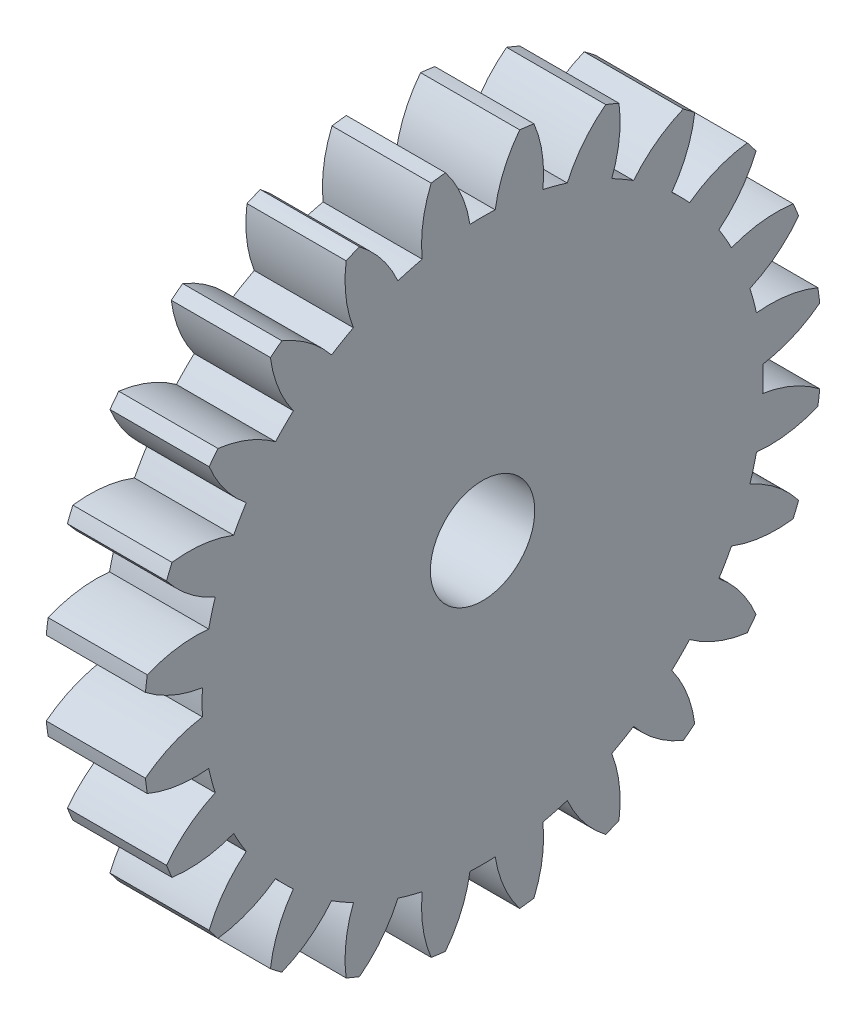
from build123d import *

# Parameters (mm, degrees)
BASPROSKE_W     = 1.9
BASPROSKE_H     = 6.5
TOOTHCUT_DEPTH  = 10.386692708
TEETHCUTS_COUNT = 24
BORSKE_R        = 1
BORE_DEPTH      = 50.0000508


with BuildPart() as part:
    # BasProSke → Base-Revolve (revolve)
    with BuildSketch(Plane(origin=(0, 0, 0), x_dir=(1, 0, 0), z_dir=(0, 1, 0)), mode=Mode.PRIVATE) as base_revolve_sk:
        with Locations((0.95, 3.25)):
            Rectangle(BASPROSKE_W, BASPROSKE_H)
    revolve(base_revolve_sk.sketch.rotate(Axis((-10, 0, 0), (1, 0, 0)), 180), axis=Axis((-10, 0, 0), (1, 0, 0)))

    # TooCutSke → ToothCut (cut, through all)
    with BuildSketch(Plane(origin=(0, 0, 0), x_dir=(0, 0, -1), z_dir=(1, 0, 0))):
        with BuildLine():
            ThreePointArc((0.241646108, 5.368564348), (0, 5.374), (-0.241646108, 5.368564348))
            ThreePointArc((-0.241646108, 5.368564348), (-0.413699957, 5.957993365), (-0.729686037, 6.48447403))
            ThreePointArc((-0.729686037, 6.48447403), (0, 6.5254), (0.729686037, 6.48447403))
            ThreePointArc((0.729686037, 6.48447403), (0.413699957, 5.957993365), (0.241646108, 5.368564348))
        make_face()
    toothcut = extrude(amount=TOOTHCUT_DEPTH, mode=Mode.SUBTRACT)

    # TeethCuts: ToothCut ×24 about axis
    teethcuts_axis = Axis((0, 0, 0), (1, 0, 0))
    for i in range(1, TEETHCUTS_COUNT):
        add(toothcut.rotate(teethcuts_axis, i * 360 / TEETHCUTS_COUNT), mode=Mode.SUBTRACT)

    # BorSke → Bore (cut, symmetric)
    with BuildSketch(Plane(origin=(0, 0, 0), x_dir=(0, 0, -1), z_dir=(1, 0, 0))):
        with Locations(Location((0, 0, 0), (0, 0, 180))):
            Circle(BORSKE_R)
    extrude(amount=BORE_DEPTH, both=True, mode=Mode.SUBTRACT)


solid = part.part
